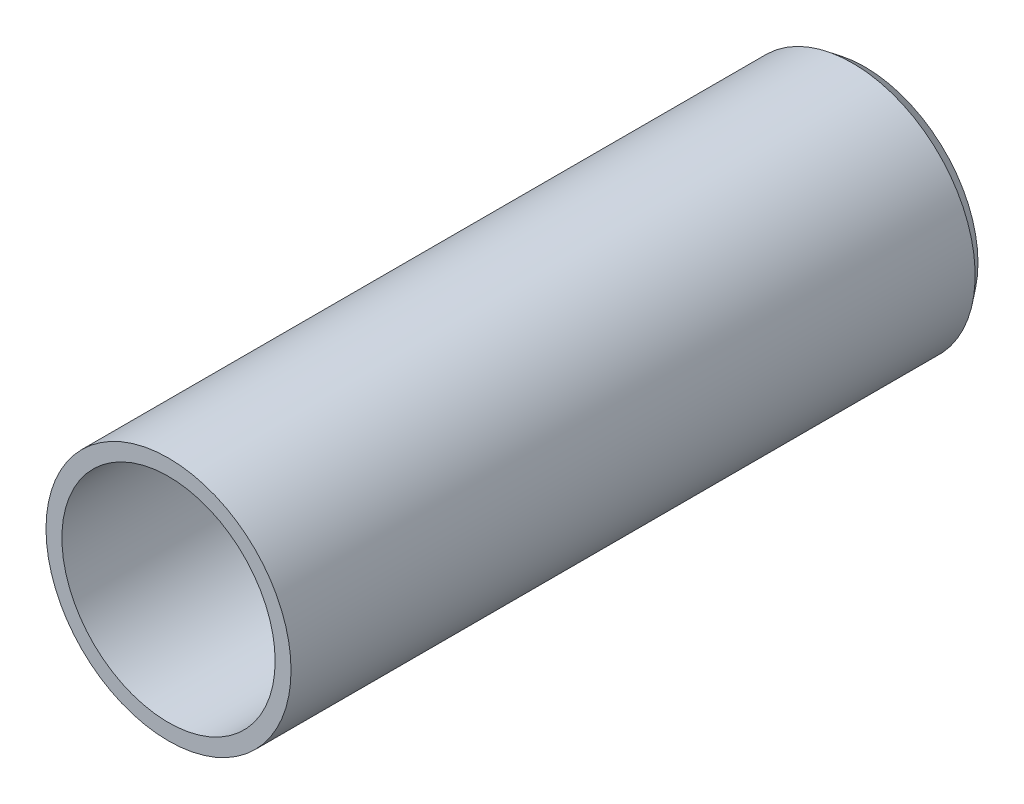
ISO-10303-21;
HEADER;
FILE_DESCRIPTION(('STEP AP214'),'2;1');
FILE_NAME('part.step','',(''),(''),'','','');
FILE_SCHEMA(('AUTOMOTIVE_DESIGN { 1 0 10303 214 1 1 1 1 }'));
ENDSEC;
DATA;
#1=APPLICATION_CONTEXT('core data for automotive mechanical design processes');
#2=APPLICATION_PROTOCOL_DEFINITION('international standard','automotive_design',2000,#1);
#3=PRODUCT_CONTEXT('',#1,'mechanical');
#4=PRODUCT('Part','Part','',(#3));
#5=PRODUCT_RELATED_PRODUCT_CATEGORY('part','',(#4));
#6=PRODUCT_DEFINITION_FORMATION('','',#4);
#7=PRODUCT_DEFINITION_CONTEXT('part definition',#1,'design');
#8=PRODUCT_DEFINITION('design','',#6,#7);
#9=PRODUCT_DEFINITION_SHAPE('','',#8);
#10=(LENGTH_UNIT() NAMED_UNIT(*) SI_UNIT(.MILLI.,.METRE.));
#11=(NAMED_UNIT(*) PLANE_ANGLE_UNIT() SI_UNIT($,.RADIAN.));
#12=(NAMED_UNIT(*) SI_UNIT($,.STERADIAN.) SOLID_ANGLE_UNIT());
#13=UNCERTAINTY_MEASURE_WITH_UNIT(LENGTH_MEASURE(1.E-05),#10,'distance_accuracy_value','');
#14=(GEOMETRIC_REPRESENTATION_CONTEXT(3) GLOBAL_UNCERTAINTY_ASSIGNED_CONTEXT((#13)) GLOBAL_UNIT_ASSIGNED_CONTEXT((#10,
#11,#12)) REPRESENTATION_CONTEXT('',''));
#15=CARTESIAN_POINT('',(0.,0.,0.));
#16=DIRECTION('',(0.,0.,1.));
#17=DIRECTION('',(1.,0.,0.));
#18=AXIS2_PLACEMENT_3D('',#15,#16,#17);
#19=CARTESIAN_POINT('',(0.,0.,0.));
#20=DIRECTION('',(0.,0.,1.));
#21=DIRECTION('',(1.,0.,0.));
#22=AXIS2_PLACEMENT_3D('',#19,#20,#21);
#23=PLANE('',#22);
#24=CARTESIAN_POINT('',(0.,0.,0.));
#25=DIRECTION('',(0.,0.,1.));
#26=DIRECTION('',(1.,0.,0.));
#27=AXIS2_PLACEMENT_3D('',#24,#25,#26);
#28=CIRCLE('',#27,26.2509);
#29=CARTESIAN_POINT('',(26.2509,0.,0.));
#30=VERTEX_POINT('',#29);
#31=EDGE_CURVE('E49',#30,#30,#28,.T.);
#32=ORIENTED_EDGE('',*,*,#31,.T.);
#33=EDGE_LOOP('',(#32));
#34=FACE_BOUND('',#33,.T.);
#35=CARTESIAN_POINT('',(0.,0.,0.));
#36=DIRECTION('',(0.,0.,-1.));
#37=DIRECTION('',(-1.,0.,0.));
#38=AXIS2_PLACEMENT_3D('',#35,#36,#37);
#39=CIRCLE('',#38,27.8384);
#40=CARTESIAN_POINT('',(-27.8384,0.,0.));
#41=VERTEX_POINT('',#40);
#42=EDGE_CURVE('E54',#41,#41,#39,.T.);
#43=ORIENTED_EDGE('',*,*,#42,.T.);
#44=EDGE_LOOP('',(#43));
#45=FACE_BOUND('',#44,.T.);
#46=ADVANCED_FACE('F39',(#34,#45),#23,.F.);
#47=CARTESIAN_POINT('',(0.,0.,171.45));
#48=DIRECTION('',(0.,0.,-1.));
#49=DIRECTION('',(-1.,0.,0.));
#50=AXIS2_PLACEMENT_3D('',#47,#48,#49);
#51=CYLINDRICAL_SURFACE('',#50,30.1625);
#52=CARTESIAN_POINT('',(0.,0.,171.45));
#53=DIRECTION('',(0.,0.,1.));
#54=DIRECTION('',(1.,0.,0.));
#55=AXIS2_PLACEMENT_3D('',#52,#53,#54);
#56=CIRCLE('',#55,30.1625);
#57=CARTESIAN_POINT('',(30.1625,0.,171.45));
#58=VERTEX_POINT('',#57);
#59=EDGE_CURVE('E10',#58,#58,#56,.T.);
#60=ORIENTED_EDGE('',*,*,#59,.F.);
#61=EDGE_LOOP('',(#60));
#62=FACE_BOUND('',#61,.T.);
#63=CARTESIAN_POINT('',(0.,0.,3.02882608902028));
#64=DIRECTION('',(0.,0.,-1.));
#65=DIRECTION('',(-1.,0.,0.));
#66=AXIS2_PLACEMENT_3D('',#63,#64,#65);
#67=CIRCLE('',#66,30.1625);
#68=CARTESIAN_POINT('',(-30.1625,0.,3.02882608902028));
#69=VERTEX_POINT('',#68);
#70=EDGE_CURVE('E56',#69,#69,#67,.T.);
#71=ORIENTED_EDGE('',*,*,#70,.F.);
#72=EDGE_LOOP('',(#71));
#73=FACE_BOUND('',#72,.T.);
#74=ADVANCED_FACE('F41',(#62,#73),#51,.T.);
#75=CARTESIAN_POINT('',(0.,0.,171.45));
#76=DIRECTION('',(0.,0.,1.));
#77=DIRECTION('',(1.,0.,0.));
#78=AXIS2_PLACEMENT_3D('',#75,#76,#77);
#79=PLANE('',#78);
#80=ORIENTED_EDGE('',*,*,#59,.T.);
#81=EDGE_LOOP('',(#80));
#82=FACE_BOUND('',#81,.T.);
#83=CARTESIAN_POINT('',(0.,0.,171.45));
#84=DIRECTION('',(0.,0.,1.));
#85=DIRECTION('',(1.,0.,0.));
#86=AXIS2_PLACEMENT_3D('',#83,#84,#85);
#87=CIRCLE('',#86,26.2509);
#88=CARTESIAN_POINT('',(26.2509,0.,171.45));
#89=VERTEX_POINT('',#88);
#90=EDGE_CURVE('E46',#89,#89,#87,.T.);
#91=ORIENTED_EDGE('',*,*,#90,.F.);
#92=EDGE_LOOP('',(#91));
#93=FACE_BOUND('',#92,.T.);
#94=ADVANCED_FACE('F66',(#82,#93),#79,.T.);
#95=CARTESIAN_POINT('',(0.,0.,171.45));
#96=DIRECTION('',(0.,0.,-1.));
#97=DIRECTION('',(-1.,0.,0.));
#98=AXIS2_PLACEMENT_3D('',#95,#96,#97);
#99=CYLINDRICAL_SURFACE('',#98,26.2509);
#100=ORIENTED_EDGE('',*,*,#90,.T.);
#101=EDGE_LOOP('',(#100));
#102=FACE_BOUND('',#101,.T.);
#103=ORIENTED_EDGE('',*,*,#31,.F.);
#104=EDGE_LOOP('',(#103));
#105=FACE_BOUND('',#104,.T.);
#106=ADVANCED_FACE('F71',(#102,#105),#99,.F.);
#107=CARTESIAN_POINT('',(0.,0.,0.));
#108=DIRECTION('',(0.,0.,1.));
#109=DIRECTION('',(1.,0.,0.));
#110=AXIS2_PLACEMENT_3D('',#107,#108,#109);
#111=CONICAL_SURFACE('',#110,27.8384,0.65449846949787);
#112=ORIENTED_EDGE('',*,*,#70,.T.);
#113=EDGE_LOOP('',(#112));
#114=FACE_BOUND('',#113,.T.);
#115=ORIENTED_EDGE('',*,*,#42,.F.);
#116=EDGE_LOOP('',(#115));
#117=FACE_BOUND('',#116,.T.);
#118=ADVANCED_FACE('F61',(#114,#117),#111,.T.);
#119=CLOSED_SHELL('',(#46,#74,#94,#106,#118));
#120=MANIFOLD_SOLID_BREP('B2',#119);
#121=ADVANCED_BREP_SHAPE_REPRESENTATION('',(#18,#120),#14);
#122=SHAPE_DEFINITION_REPRESENTATION(#9,#121);
ENDSEC;
END-ISO-10303-21;
